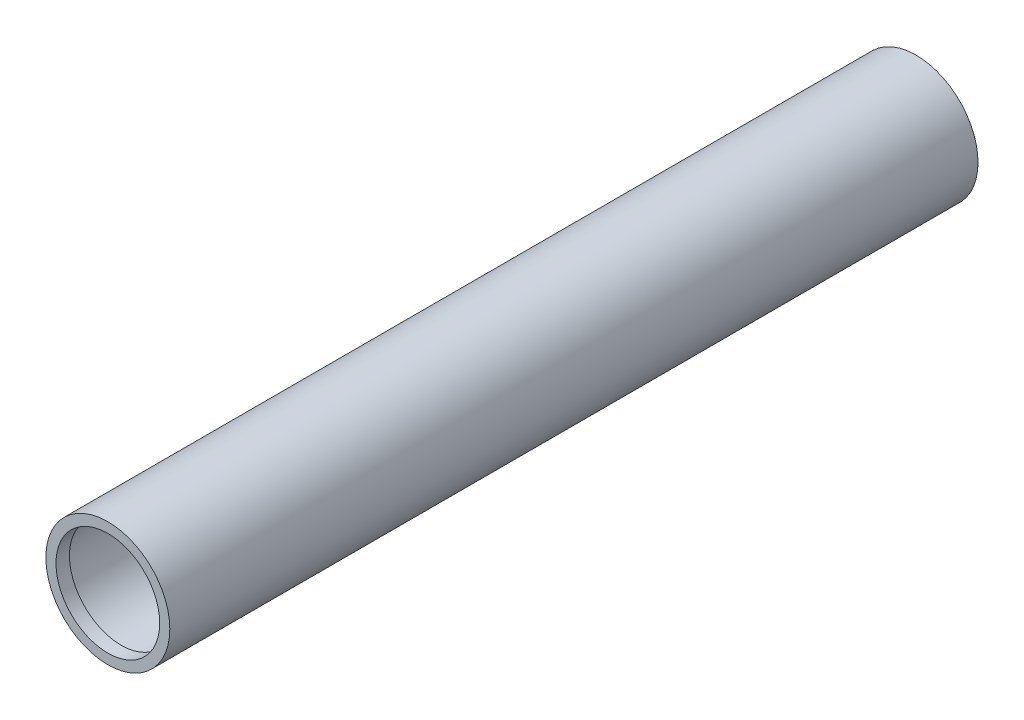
from build123d import *

# Parameters (mm, degrees)
SKETCH2_R           = 23
BOSS_EXTRUDE1_DEPTH = 300
SKETCH3_R           = 20.75
CUT_EXTRUDE1_DEPTH  = 295
SKETCH4_R           = 19.25
CUT_EXTRUDE2_DEPTH  = 295


with BuildPart() as part:
    # Sketch2 → Boss-Extrude1 (new body)
    with BuildSketch(Plane.XY):
        Circle(SKETCH2_R)
    extrude(amount=BOSS_EXTRUDE1_DEPTH)

    # Sketch3 → Cut-Extrude1 (cut)
    with BuildSketch(Plane(origin=(0, 0, 0), x_dir=(-1, 0, 0), z_dir=(0, 0, -1))):
        Circle(SKETCH3_R)
    extrude(amount=-CUT_EXTRUDE1_DEPTH, mode=Mode.SUBTRACT)

    # Sketch4 → Cut-Extrude2 (cut)
    with BuildSketch(Plane.XY.offset(300)):
        Circle(SKETCH4_R)
    extrude(amount=-CUT_EXTRUDE2_DEPTH, mode=Mode.SUBTRACT)


solid = part.part
